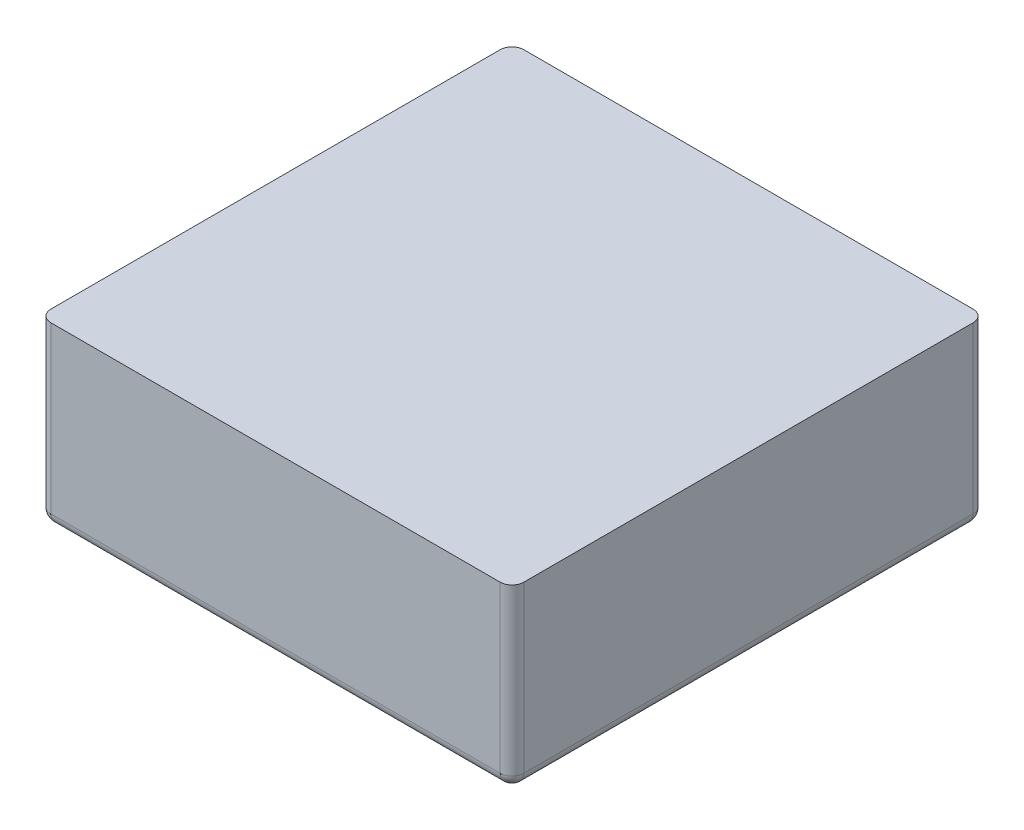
ISO-10303-21;
HEADER;
FILE_DESCRIPTION(('STEP AP214'),'2;1');
FILE_NAME('part.step','',(''),(''),'','','');
FILE_SCHEMA(('AUTOMOTIVE_DESIGN { 1 0 10303 214 1 1 1 1 }'));
ENDSEC;
DATA;
#1=APPLICATION_CONTEXT('core data for automotive mechanical design processes');
#2=APPLICATION_PROTOCOL_DEFINITION('international standard','automotive_design',2000,#1);
#3=PRODUCT_CONTEXT('',#1,'mechanical');
#4=PRODUCT('Part','Part','',(#3));
#5=PRODUCT_RELATED_PRODUCT_CATEGORY('part','',(#4));
#6=PRODUCT_DEFINITION_FORMATION('','',#4);
#7=PRODUCT_DEFINITION_CONTEXT('part definition',#1,'design');
#8=PRODUCT_DEFINITION('design','',#6,#7);
#9=PRODUCT_DEFINITION_SHAPE('','',#8);
#10=(LENGTH_UNIT() NAMED_UNIT(*) SI_UNIT(.MILLI.,.METRE.));
#11=(NAMED_UNIT(*) PLANE_ANGLE_UNIT() SI_UNIT($,.RADIAN.));
#12=(NAMED_UNIT(*) SI_UNIT($,.STERADIAN.) SOLID_ANGLE_UNIT());
#13=UNCERTAINTY_MEASURE_WITH_UNIT(LENGTH_MEASURE(1.E-05),#10,'distance_accuracy_value','');
#14=(GEOMETRIC_REPRESENTATION_CONTEXT(3) GLOBAL_UNCERTAINTY_ASSIGNED_CONTEXT((#13)) GLOBAL_UNIT_ASSIGNED_CONTEXT((#10,
#11,#12)) REPRESENTATION_CONTEXT('',''));
#15=CARTESIAN_POINT('',(0.,0.,0.));
#16=DIRECTION('',(0.,0.,1.));
#17=DIRECTION('',(1.,0.,0.));
#18=AXIS2_PLACEMENT_3D('',#15,#16,#17);
#19=CARTESIAN_POINT('',(0.38,-0.3,-0.38));
#20=DIRECTION('',(0.,-1.,0.));
#21=DIRECTION('',(0.,0.,1.));
#22=AXIS2_PLACEMENT_3D('',#19,#20,#21);
#23=CYLINDRICAL_SURFACE('',#22,0.02);
#24=CARTESIAN_POINT('',(0.38,-0.28,-0.38));
#25=DIRECTION('',(0.,-1.,0.));
#26=DIRECTION('',(0.,0.,-1.));
#27=AXIS2_PLACEMENT_3D('',#24,#25,#26);
#28=CIRCLE('',#27,0.02);
#29=CARTESIAN_POINT('',(0.38,-0.28,-0.4));
#30=VERTEX_POINT('',#29);
#31=CARTESIAN_POINT('',(0.4,-0.28,-0.38));
#32=VERTEX_POINT('',#31);
#33=EDGE_CURVE('E11',#30,#32,#28,.T.);
#34=ORIENTED_EDGE('',*,*,#33,.F.);
#35=DIRECTION('',(0.,1.,0.));
#36=VECTOR('',#35,1.);
#37=CARTESIAN_POINT('',(0.38,-0.3,-0.4));
#38=LINE('',#37,#36);
#39=CARTESIAN_POINT('',(0.38,0.,-0.4));
#40=VERTEX_POINT('',#39);
#41=EDGE_CURVE('E160',#30,#40,#38,.T.);
#42=ORIENTED_EDGE('',*,*,#41,.T.);
#43=CARTESIAN_POINT('',(0.38,0.,-0.38));
#44=DIRECTION('',(0.,-1.,0.));
#45=DIRECTION('',(0.,0.,-1.));
#46=AXIS2_PLACEMENT_3D('',#43,#44,#45);
#47=CIRCLE('',#46,0.02);
#48=CARTESIAN_POINT('',(0.4,0.,-0.38));
#49=VERTEX_POINT('',#48);
#50=EDGE_CURVE('E130',#40,#49,#47,.T.);
#51=ORIENTED_EDGE('',*,*,#50,.T.);
#52=DIRECTION('',(0.,1.,0.));
#53=VECTOR('',#52,1.);
#54=CARTESIAN_POINT('',(0.4,-0.3,-0.38));
#55=LINE('',#54,#53);
#56=EDGE_CURVE('E171',#32,#49,#55,.T.);
#57=ORIENTED_EDGE('',*,*,#56,.F.);
#58=EDGE_LOOP('',(#34,#42,#51,#57));
#59=FACE_BOUND('',#58,.T.);
#60=ADVANCED_FACE('F17',(#59),#23,.T.);
#61=CARTESIAN_POINT('',(0.38,-0.28,-0.38));
#62=DIRECTION('',(0.,0.,1.));
#63=DIRECTION('',(1.,0.,0.));
#64=AXIS2_PLACEMENT_3D('',#61,#62,#63);
#65=SPHERICAL_SURFACE('',#64,0.02);
#66=CARTESIAN_POINT('',(0.38,-0.28,-0.38));
#67=DIRECTION('',(0.,0.,-1.));
#68=DIRECTION('',(-1.,0.,0.));
#69=AXIS2_PLACEMENT_3D('',#66,#67,#68);
#70=CIRCLE('',#69,0.02);
#71=CARTESIAN_POINT('',(0.38,-0.3,-0.38));
#72=VERTEX_POINT('',#71);
#73=EDGE_CURVE('E26',#32,#72,#70,.T.);
#74=ORIENTED_EDGE('',*,*,#73,.T.);
#75=CARTESIAN_POINT('',(0.38,-0.28,-0.38));
#76=DIRECTION('',(1.,0.,0.));
#77=DIRECTION('',(0.,0.,-1.));
#78=AXIS2_PLACEMENT_3D('',#75,#76,#77);
#79=CIRCLE('',#78,0.02);
#80=EDGE_CURVE('E237',#72,#30,#79,.T.);
#81=ORIENTED_EDGE('',*,*,#80,.T.);
#82=ORIENTED_EDGE('',*,*,#33,.T.);
#83=EDGE_LOOP('',(#74,#81,#82));
#84=FACE_BOUND('',#83,.T.);
#85=ADVANCED_FACE('F300',(#84),#65,.T.);
#86=CARTESIAN_POINT('',(0.38,-0.28,-0.4));
#87=DIRECTION('',(0.,0.,1.));
#88=DIRECTION('',(-1.,0.,0.));
#89=AXIS2_PLACEMENT_3D('',#86,#87,#88);
#90=CYLINDRICAL_SURFACE('',#89,0.02);
#91=CARTESIAN_POINT('',(0.38,-0.28,0.38));
#92=DIRECTION('',(0.,0.,1.));
#93=DIRECTION('',(1.,0.,0.));
#94=AXIS2_PLACEMENT_3D('',#91,#92,#93);
#95=CIRCLE('',#94,0.02);
#96=CARTESIAN_POINT('',(0.38,-0.3,0.38));
#97=VERTEX_POINT('',#96);
#98=CARTESIAN_POINT('',(0.4,-0.28,0.38));
#99=VERTEX_POINT('',#98);
#100=EDGE_CURVE('E223',#97,#99,#95,.T.);
#101=ORIENTED_EDGE('',*,*,#100,.F.);
#102=DIRECTION('',(0.,0.,1.));
#103=VECTOR('',#102,1.);
#104=CARTESIAN_POINT('',(0.38,-0.3,0.4));
#105=LINE('',#104,#103);
#106=EDGE_CURVE('E197',#72,#97,#105,.T.);
#107=ORIENTED_EDGE('',*,*,#106,.F.);
#108=ORIENTED_EDGE('',*,*,#73,.F.);
#109=DIRECTION('',(0.,0.,1.));
#110=VECTOR('',#109,1.);
#111=CARTESIAN_POINT('',(0.4,-0.28,-0.4));
#112=LINE('',#111,#110);
#113=EDGE_CURVE('E159',#32,#99,#112,.T.);
#114=ORIENTED_EDGE('',*,*,#113,.T.);
#115=EDGE_LOOP('',(#101,#107,#108,#114));
#116=FACE_BOUND('',#115,.T.);
#117=ADVANCED_FACE('F261',(#116),#90,.T.);
#118=CARTESIAN_POINT('',(0.38,-0.3,0.38));
#119=DIRECTION('',(0.,-1.,0.));
#120=DIRECTION('',(0.,0.,1.));
#121=AXIS2_PLACEMENT_3D('',#118,#119,#120);
#122=CYLINDRICAL_SURFACE('',#121,0.02);
#123=CARTESIAN_POINT('',(0.38,0.,0.38));
#124=DIRECTION('',(0.,-1.,0.));
#125=DIRECTION('',(0.,0.,-1.));
#126=AXIS2_PLACEMENT_3D('',#123,#124,#125);
#127=CIRCLE('',#126,0.02);
#128=CARTESIAN_POINT('',(0.4,0.,0.38));
#129=VERTEX_POINT('',#128);
#130=CARTESIAN_POINT('',(0.38,0.,0.4));
#131=VERTEX_POINT('',#130);
#132=EDGE_CURVE('E206',#129,#131,#127,.T.);
#133=ORIENTED_EDGE('',*,*,#132,.T.);
#134=DIRECTION('',(0.,1.,0.));
#135=VECTOR('',#134,1.);
#136=CARTESIAN_POINT('',(0.38,-0.3,0.4));
#137=LINE('',#136,#135);
#138=CARTESIAN_POINT('',(0.38,-0.28,0.4));
#139=VERTEX_POINT('',#138);
#140=EDGE_CURVE('E184',#139,#131,#137,.T.);
#141=ORIENTED_EDGE('',*,*,#140,.F.);
#142=CARTESIAN_POINT('',(0.38,-0.28,0.38));
#143=DIRECTION('',(0.,-1.,0.));
#144=DIRECTION('',(0.,0.,-1.));
#145=AXIS2_PLACEMENT_3D('',#142,#143,#144);
#146=CIRCLE('',#145,0.02);
#147=EDGE_CURVE('E268',#99,#139,#146,.T.);
#148=ORIENTED_EDGE('',*,*,#147,.F.);
#149=DIRECTION('',(0.,1.,0.));
#150=VECTOR('',#149,1.);
#151=CARTESIAN_POINT('',(0.4,-0.3,0.38));
#152=LINE('',#151,#150);
#153=EDGE_CURVE('E176',#99,#129,#152,.T.);
#154=ORIENTED_EDGE('',*,*,#153,.T.);
#155=EDGE_LOOP('',(#133,#141,#148,#154));
#156=FACE_BOUND('',#155,.T.);
#157=ADVANCED_FACE('F282',(#156),#122,.T.);
#158=CARTESIAN_POINT('',(-0.4,-0.28,0.38));
#159=DIRECTION('',(-1.,0.,0.));
#160=DIRECTION('',(0.,0.,-1.));
#161=AXIS2_PLACEMENT_3D('',#158,#159,#160);
#162=CYLINDRICAL_SURFACE('',#161,0.02);
#163=CARTESIAN_POINT('',(-0.38,-0.28,0.38));
#164=DIRECTION('',(-1.,0.,0.));
#165=DIRECTION('',(0.,0.,1.));
#166=AXIS2_PLACEMENT_3D('',#163,#164,#165);
#167=CIRCLE('',#166,0.02);
#168=CARTESIAN_POINT('',(-0.38,-0.3,0.38));
#169=VERTEX_POINT('',#168);
#170=CARTESIAN_POINT('',(-0.38,-0.28,0.4));
#171=VERTEX_POINT('',#170);
#172=EDGE_CURVE('E209',#169,#171,#167,.T.);
#173=ORIENTED_EDGE('',*,*,#172,.F.);
#174=DIRECTION('',(-1.,0.,0.));
#175=VECTOR('',#174,1.);
#176=CARTESIAN_POINT('',(-0.4,-0.3,0.38));
#177=LINE('',#176,#175);
#178=EDGE_CURVE('E198',#97,#169,#177,.T.);
#179=ORIENTED_EDGE('',*,*,#178,.F.);
#180=CARTESIAN_POINT('',(0.38,-0.28,0.38));
#181=DIRECTION('',(1.,0.,0.));
#182=DIRECTION('',(0.,0.,-1.));
#183=AXIS2_PLACEMENT_3D('',#180,#181,#182);
#184=CIRCLE('',#183,0.02);
#185=EDGE_CURVE('E221',#139,#97,#184,.T.);
#186=ORIENTED_EDGE('',*,*,#185,.F.);
#187=DIRECTION('',(-1.,0.,0.));
#188=VECTOR('',#187,1.);
#189=CARTESIAN_POINT('',(0.4,-0.28,0.4));
#190=LINE('',#189,#188);
#191=EDGE_CURVE('E180',#139,#171,#190,.T.);
#192=ORIENTED_EDGE('',*,*,#191,.T.);
#193=EDGE_LOOP('',(#173,#179,#186,#192));
#194=FACE_BOUND('',#193,.T.);
#195=ADVANCED_FACE('F312',(#194),#162,.T.);
#196=CARTESIAN_POINT('',(-0.38,-0.28,-0.4));
#197=DIRECTION('',(0.,0.,-1.));
#198=DIRECTION('',(1.,0.,0.));
#199=AXIS2_PLACEMENT_3D('',#196,#197,#198);
#200=CYLINDRICAL_SURFACE('',#199,0.02);
#201=CARTESIAN_POINT('',(-0.38,-0.28,0.38));
#202=DIRECTION('',(0.,0.,1.));
#203=DIRECTION('',(0.,-1.,0.));
#204=AXIS2_PLACEMENT_3D('',#201,#202,#203);
#205=CIRCLE('',#204,0.02);
#206=CARTESIAN_POINT('',(-0.4,-0.28,0.38));
#207=VERTEX_POINT('',#206);
#208=EDGE_CURVE('E20',#207,#169,#205,.T.);
#209=ORIENTED_EDGE('',*,*,#208,.F.);
#210=DIRECTION('',(0.,0.,-1.));
#211=VECTOR('',#210,1.);
#212=CARTESIAN_POINT('',(-0.4,-0.28,0.4));
#213=LINE('',#212,#211);
#214=CARTESIAN_POINT('',(-0.4,-0.28,-0.38));
#215=VERTEX_POINT('',#214);
#216=EDGE_CURVE('E142',#207,#215,#213,.T.);
#217=ORIENTED_EDGE('',*,*,#216,.T.);
#218=CARTESIAN_POINT('',(-0.38,-0.28,-0.38));
#219=DIRECTION('',(0.,0.,-1.));
#220=DIRECTION('',(-1.,0.,0.));
#221=AXIS2_PLACEMENT_3D('',#218,#219,#220);
#222=CIRCLE('',#221,0.02);
#223=CARTESIAN_POINT('',(-0.38,-0.3,-0.38));
#224=VERTEX_POINT('',#223);
#225=EDGE_CURVE('E153',#224,#215,#222,.T.);
#226=ORIENTED_EDGE('',*,*,#225,.F.);
#227=DIRECTION('',(0.,0.,-1.));
#228=VECTOR('',#227,1.);
#229=CARTESIAN_POINT('',(-0.38,-0.3,-0.4));
#230=LINE('',#229,#228);
#231=EDGE_CURVE('E192',#169,#224,#230,.T.);
#232=ORIENTED_EDGE('',*,*,#231,.F.);
#233=EDGE_LOOP('',(#209,#217,#226,#232));
#234=FACE_BOUND('',#233,.T.);
#235=ADVANCED_FACE('F296',(#234),#200,.T.);
#236=CARTESIAN_POINT('',(-0.38,-0.3,-0.38));
#237=DIRECTION('',(0.,-1.,0.));
#238=DIRECTION('',(0.,0.,1.));
#239=AXIS2_PLACEMENT_3D('',#236,#237,#238);
#240=CYLINDRICAL_SURFACE('',#239,0.02);
#241=CARTESIAN_POINT('',(-0.38,0.,-0.38));
#242=DIRECTION('',(0.,-1.,0.));
#243=DIRECTION('',(0.,0.,-1.));
#244=AXIS2_PLACEMENT_3D('',#241,#242,#243);
#245=CIRCLE('',#244,0.02);
#246=CARTESIAN_POINT('',(-0.4,0.,-0.38));
#247=VERTEX_POINT('',#246);
#248=CARTESIAN_POINT('',(-0.38,0.,-0.4));
#249=VERTEX_POINT('',#248);
#250=EDGE_CURVE('E119',#247,#249,#245,.T.);
#251=ORIENTED_EDGE('',*,*,#250,.T.);
#252=DIRECTION('',(0.,1.,0.));
#253=VECTOR('',#252,1.);
#254=CARTESIAN_POINT('',(-0.38,-0.3,-0.4));
#255=LINE('',#254,#253);
#256=CARTESIAN_POINT('',(-0.38,-0.28,-0.4));
#257=VERTEX_POINT('',#256);
#258=EDGE_CURVE('E157',#257,#249,#255,.T.);
#259=ORIENTED_EDGE('',*,*,#258,.F.);
#260=CARTESIAN_POINT('',(-0.38,-0.28,-0.38));
#261=DIRECTION('',(0.,-1.,0.));
#262=DIRECTION('',(0.,0.,-1.));
#263=AXIS2_PLACEMENT_3D('',#260,#261,#262);
#264=CIRCLE('',#263,0.02);
#265=EDGE_CURVE('E137',#215,#257,#264,.T.);
#266=ORIENTED_EDGE('',*,*,#265,.F.);
#267=DIRECTION('',(0.,1.,0.));
#268=VECTOR('',#267,1.);
#269=CARTESIAN_POINT('',(-0.4,-0.3,-0.38));
#270=LINE('',#269,#268);
#271=EDGE_CURVE('E134',#215,#247,#270,.T.);
#272=ORIENTED_EDGE('',*,*,#271,.T.);
#273=EDGE_LOOP('',(#251,#259,#266,#272));
#274=FACE_BOUND('',#273,.T.);
#275=ADVANCED_FACE('F135',(#274),#240,.T.);
#276=CARTESIAN_POINT('',(-0.38,-0.28,0.38));
#277=DIRECTION('',(0.,0.,1.));
#278=DIRECTION('',(1.,0.,0.));
#279=AXIS2_PLACEMENT_3D('',#276,#277,#278);
#280=SPHERICAL_SURFACE('',#279,0.02);
#281=ORIENTED_EDGE('',*,*,#172,.T.);
#282=CARTESIAN_POINT('',(-0.38,-0.28,0.38));
#283=DIRECTION('',(0.,-1.,0.));
#284=DIRECTION('',(0.,0.,-1.));
#285=AXIS2_PLACEMENT_3D('',#282,#283,#284);
#286=CIRCLE('',#285,0.02);
#287=EDGE_CURVE('E208',#171,#207,#286,.T.);
#288=ORIENTED_EDGE('',*,*,#287,.T.);
#289=ORIENTED_EDGE('',*,*,#208,.T.);
#290=EDGE_LOOP('',(#281,#288,#289));
#291=FACE_BOUND('',#290,.T.);
#292=ADVANCED_FACE('F315',(#291),#280,.T.);
#293=CARTESIAN_POINT('',(-0.38,-0.3,0.38));
#294=DIRECTION('',(0.,-1.,0.));
#295=DIRECTION('',(0.,0.,1.));
#296=AXIS2_PLACEMENT_3D('',#293,#294,#295);
#297=CYLINDRICAL_SURFACE('',#296,0.02);
#298=ORIENTED_EDGE('',*,*,#287,.F.);
#299=DIRECTION('',(0.,1.,0.));
#300=VECTOR('',#299,1.);
#301=CARTESIAN_POINT('',(-0.38,-0.3,0.4));
#302=LINE('',#301,#300);
#303=CARTESIAN_POINT('',(-0.38,0.,0.4));
#304=VERTEX_POINT('',#303);
#305=EDGE_CURVE('E189',#171,#304,#302,.T.);
#306=ORIENTED_EDGE('',*,*,#305,.T.);
#307=CARTESIAN_POINT('',(-0.38,0.,0.38));
#308=DIRECTION('',(0.,-1.,0.));
#309=DIRECTION('',(0.,0.,-1.));
#310=AXIS2_PLACEMENT_3D('',#307,#308,#309);
#311=CIRCLE('',#310,0.02);
#312=CARTESIAN_POINT('',(-0.4,0.,0.38));
#313=VERTEX_POINT('',#312);
#314=EDGE_CURVE('E48',#304,#313,#311,.T.);
#315=ORIENTED_EDGE('',*,*,#314,.T.);
#316=DIRECTION('',(0.,1.,0.));
#317=VECTOR('',#316,1.);
#318=CARTESIAN_POINT('',(-0.4,-0.3,0.38));
#319=LINE('',#318,#317);
#320=EDGE_CURVE('E147',#207,#313,#319,.T.);
#321=ORIENTED_EDGE('',*,*,#320,.F.);
#322=EDGE_LOOP('',(#298,#306,#315,#321));
#323=FACE_BOUND('',#322,.T.);
#324=ADVANCED_FACE('F316',(#323),#297,.T.);
#325=CARTESIAN_POINT('',(-0.4,0.,-0.4));
#326=DIRECTION('',(0.,-1.,0.));
#327=DIRECTION('',(0.,0.,-1.));
#328=AXIS2_PLACEMENT_3D('',#325,#326,#327);
#329=PLANE('',#328);
#330=DIRECTION('',(0.,0.,1.));
#331=VECTOR('',#330,1.);
#332=CARTESIAN_POINT('',(0.4,0.,-0.4));
#333=LINE('',#332,#331);
#334=EDGE_CURVE('E175',#49,#129,#333,.T.);
#335=ORIENTED_EDGE('',*,*,#334,.F.);
#336=ORIENTED_EDGE('',*,*,#50,.F.);
#337=DIRECTION('',(1.,0.,0.));
#338=VECTOR('',#337,1.);
#339=CARTESIAN_POINT('',(-0.4,0.,-0.4));
#340=LINE('',#339,#338);
#341=EDGE_CURVE('E126',#249,#40,#340,.T.);
#342=ORIENTED_EDGE('',*,*,#341,.F.);
#343=ORIENTED_EDGE('',*,*,#250,.F.);
#344=DIRECTION('',(0.,0.,-1.));
#345=VECTOR('',#344,1.);
#346=CARTESIAN_POINT('',(-0.4,0.,0.4));
#347=LINE('',#346,#345);
#348=EDGE_CURVE('E124',#313,#247,#347,.T.);
#349=ORIENTED_EDGE('',*,*,#348,.F.);
#350=ORIENTED_EDGE('',*,*,#314,.F.);
#351=DIRECTION('',(-1.,0.,0.));
#352=VECTOR('',#351,1.);
#353=CARTESIAN_POINT('',(0.4,0.,0.4));
#354=LINE('',#353,#352);
#355=EDGE_CURVE('E187',#131,#304,#354,.T.);
#356=ORIENTED_EDGE('',*,*,#355,.F.);
#357=ORIENTED_EDGE('',*,*,#132,.F.);
#358=EDGE_LOOP('',(#335,#336,#342,#343,#349,#350,#356,#357));
#359=FACE_BOUND('',#358,.T.);
#360=ADVANCED_FACE('F122',(#359),#329,.F.);
#361=CARTESIAN_POINT('',(-0.4,-0.3,-0.4));
#362=DIRECTION('',(0.,-1.,0.));
#363=DIRECTION('',(0.,0.,-1.));
#364=AXIS2_PLACEMENT_3D('',#361,#362,#363);
#365=PLANE('',#364);
#366=ORIENTED_EDGE('',*,*,#231,.T.);
#367=DIRECTION('',(1.,0.,0.));
#368=VECTOR('',#367,1.);
#369=CARTESIAN_POINT('',(0.4,-0.3,-0.38));
#370=LINE('',#369,#368);
#371=EDGE_CURVE('E243',#224,#72,#370,.T.);
#372=ORIENTED_EDGE('',*,*,#371,.T.);
#373=ORIENTED_EDGE('',*,*,#106,.T.);
#374=ORIENTED_EDGE('',*,*,#178,.T.);
#375=EDGE_LOOP('',(#366,#372,#373,#374));
#376=FACE_BOUND('',#375,.T.);
#377=ADVANCED_FACE('F254',(#376),#365,.T.);
#378=CARTESIAN_POINT('',(0.4,-0.3,0.4));
#379=DIRECTION('',(0.,0.,-1.));
#380=DIRECTION('',(0.,-1.,0.));
#381=AXIS2_PLACEMENT_3D('',#378,#379,#380);
#382=PLANE('',#381);
#383=ORIENTED_EDGE('',*,*,#191,.F.);
#384=ORIENTED_EDGE('',*,*,#140,.T.);
#385=ORIENTED_EDGE('',*,*,#355,.T.);
#386=ORIENTED_EDGE('',*,*,#305,.F.);
#387=EDGE_LOOP('',(#383,#384,#385,#386));
#388=FACE_BOUND('',#387,.T.);
#389=ADVANCED_FACE('F280',(#388),#382,.F.);
#390=CARTESIAN_POINT('',(0.4,-0.3,-0.4));
#391=DIRECTION('',(-1.,0.,0.));
#392=DIRECTION('',(0.,0.,1.));
#393=AXIS2_PLACEMENT_3D('',#390,#391,#392);
#394=PLANE('',#393);
#395=ORIENTED_EDGE('',*,*,#113,.F.);
#396=ORIENTED_EDGE('',*,*,#56,.T.);
#397=ORIENTED_EDGE('',*,*,#334,.T.);
#398=ORIENTED_EDGE('',*,*,#153,.F.);
#399=EDGE_LOOP('',(#395,#396,#397,#398));
#400=FACE_BOUND('',#399,.T.);
#401=ADVANCED_FACE('F284',(#400),#394,.F.);
#402=CARTESIAN_POINT('',(-0.4,-0.3,-0.4));
#403=DIRECTION('',(0.,0.,1.));
#404=DIRECTION('',(1.,0.,0.));
#405=AXIS2_PLACEMENT_3D('',#402,#403,#404);
#406=PLANE('',#405);
#407=ORIENTED_EDGE('',*,*,#341,.T.);
#408=ORIENTED_EDGE('',*,*,#41,.F.);
#409=DIRECTION('',(1.,0.,0.));
#410=VECTOR('',#409,1.);
#411=CARTESIAN_POINT('',(-0.4,-0.28,-0.4));
#412=LINE('',#411,#410);
#413=EDGE_CURVE('E233',#257,#30,#412,.T.);
#414=ORIENTED_EDGE('',*,*,#413,.F.);
#415=ORIENTED_EDGE('',*,*,#258,.T.);
#416=EDGE_LOOP('',(#407,#408,#414,#415));
#417=FACE_BOUND('',#416,.T.);
#418=ADVANCED_FACE('F290',(#417),#406,.F.);
#419=CARTESIAN_POINT('',(-0.4,-0.3,0.4));
#420=DIRECTION('',(1.,0.,0.));
#421=DIRECTION('',(0.,1.,0.));
#422=AXIS2_PLACEMENT_3D('',#419,#420,#421);
#423=PLANE('',#422);
#424=ORIENTED_EDGE('',*,*,#348,.T.);
#425=ORIENTED_EDGE('',*,*,#271,.F.);
#426=ORIENTED_EDGE('',*,*,#216,.F.);
#427=ORIENTED_EDGE('',*,*,#320,.T.);
#428=EDGE_LOOP('',(#424,#425,#426,#427));
#429=FACE_BOUND('',#428,.T.);
#430=ADVANCED_FACE('F145',(#429),#423,.F.);
#431=CARTESIAN_POINT('',(-0.38,-0.28,-0.38));
#432=DIRECTION('',(0.,0.,1.));
#433=DIRECTION('',(1.,0.,0.));
#434=AXIS2_PLACEMENT_3D('',#431,#432,#433);
#435=SPHERICAL_SURFACE('',#434,0.02);
#436=ORIENTED_EDGE('',*,*,#225,.T.);
#437=ORIENTED_EDGE('',*,*,#265,.T.);
#438=CARTESIAN_POINT('',(-0.38,-0.28,-0.38));
#439=DIRECTION('',(-1.,0.,0.));
#440=DIRECTION('',(0.,0.,1.));
#441=AXIS2_PLACEMENT_3D('',#438,#439,#440);
#442=CIRCLE('',#441,0.02);
#443=EDGE_CURVE('E226',#257,#224,#442,.T.);
#444=ORIENTED_EDGE('',*,*,#443,.T.);
#445=EDGE_LOOP('',(#436,#437,#444));
#446=FACE_BOUND('',#445,.T.);
#447=ADVANCED_FACE('F293',(#446),#435,.T.);
#448=CARTESIAN_POINT('',(-0.4,-0.28,-0.38));
#449=DIRECTION('',(1.,0.,0.));
#450=DIRECTION('',(0.,0.,1.));
#451=AXIS2_PLACEMENT_3D('',#448,#449,#450);
#452=CYLINDRICAL_SURFACE('',#451,0.02);
#453=ORIENTED_EDGE('',*,*,#443,.F.);
#454=ORIENTED_EDGE('',*,*,#413,.T.);
#455=ORIENTED_EDGE('',*,*,#80,.F.);
#456=ORIENTED_EDGE('',*,*,#371,.F.);
#457=EDGE_LOOP('',(#453,#454,#455,#456));
#458=FACE_BOUND('',#457,.T.);
#459=ADVANCED_FACE('F298',(#458),#452,.T.);
#460=CARTESIAN_POINT('',(0.38,-0.28,0.38));
#461=DIRECTION('',(0.,0.,1.));
#462=DIRECTION('',(1.,0.,0.));
#463=AXIS2_PLACEMENT_3D('',#460,#461,#462);
#464=SPHERICAL_SURFACE('',#463,0.02);
#465=ORIENTED_EDGE('',*,*,#147,.T.);
#466=ORIENTED_EDGE('',*,*,#185,.T.);
#467=ORIENTED_EDGE('',*,*,#100,.T.);
#468=EDGE_LOOP('',(#465,#466,#467));
#469=FACE_BOUND('',#468,.T.);
#470=ADVANCED_FACE('F267',(#469),#464,.T.);
#471=CLOSED_SHELL('',(#60,#85,#117,#157,#195,#235,#275,#292,#324,#360,#377,#389,#401,#418,#430,
#447,#459,#470));
#472=MANIFOLD_SOLID_BREP('B1',#471);
#473=ADVANCED_BREP_SHAPE_REPRESENTATION('',(#18,#472),#14);
#474=SHAPE_DEFINITION_REPRESENTATION(#9,#473);
ENDSEC;
END-ISO-10303-21;
